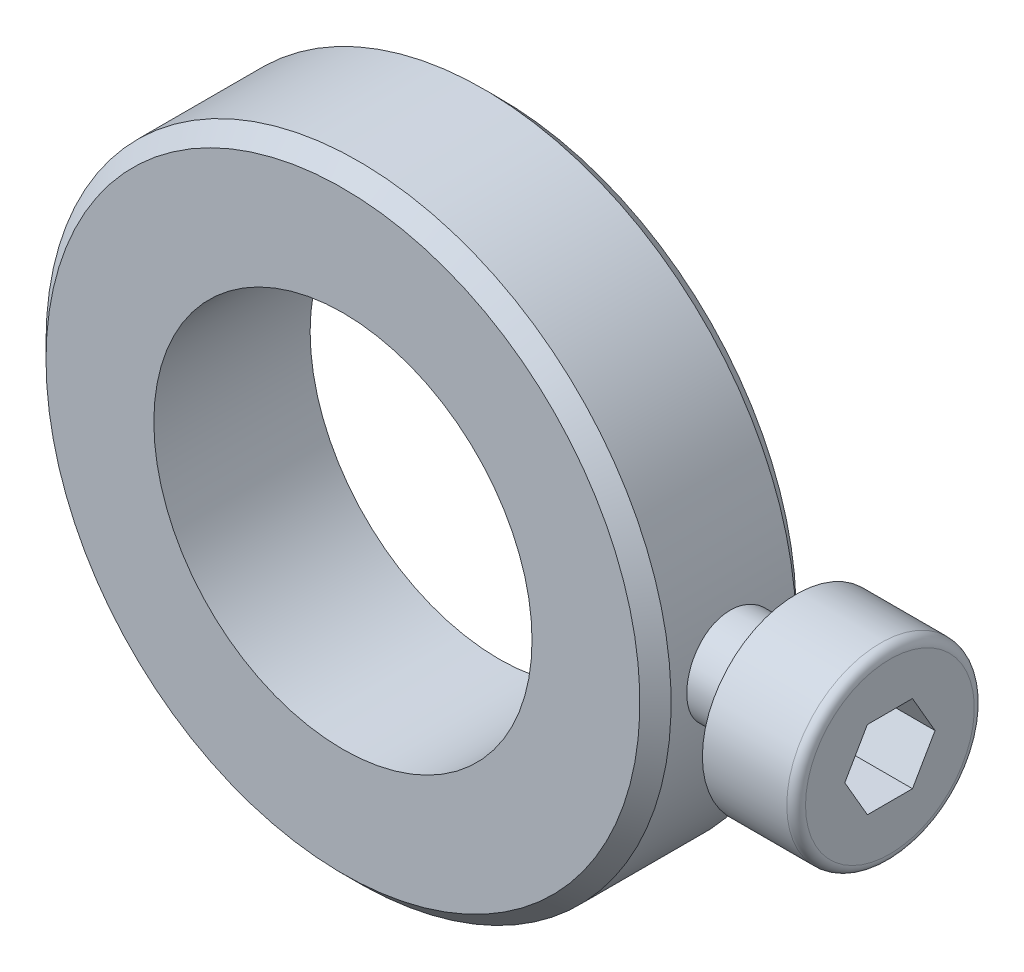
from build123d import *

# Parameters (mm, degrees)
ESQUISSE1_R             = 10
BASE_EXTRUSION_DEPTH    = 2.5
CHANFREIN1_SIZE         = 0.5
ESQUISSE2_R             = 6.05
ENL_V_MAT_EXTRU_1_DEPTH = 16
ENL_V_MAT_EXTRU_2_DEPTH = 2


with BuildPart() as part:
    # Esquisse1 → Base-Extrusion (new, symmetric)
    with BuildSketch(Plane.XY):
        with Locations(Location((0, 0, 0), (0, 0, 180))):
            Circle(ESQUISSE1_R)
    extrude(amount=BASE_EXTRUSION_DEPTH, both=True)

    # Chanfrein1
    chanfrein1_edges = [part.edges().sort_by_distance(p)[0] for p in [
        (10, 0, 2.5),
        (10, 0, -2.5),
    ]]
    chamfer(chanfrein1_edges, length=CHANFREIN1_SIZE)

    # Esquisse2 → Enl_v. mat.-Extru.1 (cut, through all)
    with BuildSketch(Plane.XY.offset(2.5)):
        Circle(ESQUISSE2_R)
    extrude(amount=-ENL_V_MAT_EXTRU_1_DEPTH, mode=Mode.SUBTRACT)

    # Esquisse3 → R_volution1 (revolve)
    with BuildSketch(Plane.XY, mode=Mode.PRIVATE) as r_volution1_sk:
        with BuildLine():
            Line((8.969132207, 1.5), (12, 1.5))
            Line((12, 1.5), (12, 3))
            Line((12, 3), (14.7, 3))
            ThreePointArc((14.7, 3), (14.912132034, 2.912132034), (15, 2.7))
            Line((15, 2.7), (15, 0))
            Line((15, 0), (8.969132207, 0))
            Line((8.969132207, 0), (8.969132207, 1.5))
        make_face()
    revolve(r_volution1_sk.sketch.rotate(Axis((0, 0, 0), (1, 0, 0)), 90), axis=Axis((0, 0, 0), (1, 0, 0)))

    # Esquisse4 → Enl_v. mat.-Extru.2 (cut)
    with BuildSketch(Plane(origin=(15, 0, 0), x_dir=(0, 0, -1), z_dir=(1, 0, 0))):
        Polygon((0.722776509, -1.249370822), (1.443375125, 0.001257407), (0.720598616, 1.250628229), (-0.722776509, 1.249370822), (-1.443375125, -0.001257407), (-0.720598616, -1.250628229), align=None)
    extrude(amount=-ENL_V_MAT_EXTRU_2_DEPTH, mode=Mode.SUBTRACT)


solid = part.part
